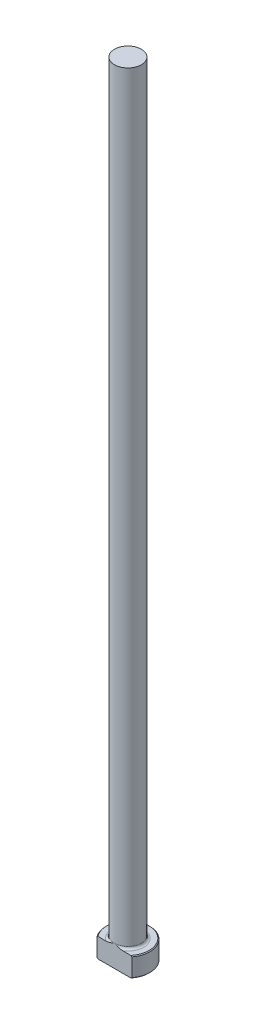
from build123d import *

# Parameters (mm, degrees)
CHAMFER1_SIZE = 0.254
FILLET1_R     = 0.762
KEY_DEPTH     = 255.20048182


with BuildPart() as part:
    # Sketch1 → Revolve1 (revolve)
    with BuildSketch(Plane.XY, mode=Mode.PRIVATE) as revolve1_sk:
        Polygon((0, 0), (-7.1374, 0), (-7.1374, 6.35), (-4.36499, 6.35), (-4.36499, 254), (0, 254), align=None)
    revolve(revolve1_sk.sketch.rotate(Axis((0, 259.958771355, 0), (0, -1, 0)), 270), axis=Axis((0, 259.958771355, 0), (0, -1, 0)))

    # Chamfer1
    chamfer1_edges = [part.edges().sort_by_distance(p)[0] for p in [
        (0, 6.35, -7.1374),
        (0, 0, -7.1374),
    ]]
    chamfer(chamfer1_edges, length=CHAMFER1_SIZE)

    # Fillet1
    fillet1_edges = [part.edges().sort_by_distance(p)[0] for p in [
        (0, 6.35, -4.36499),
    ]]
    fillet(fillet1_edges, radius=FILLET1_R)

    # Sketch2 → Key (cut, through all)
    with BuildSketch(Plane(origin=(0, 0, 0), x_dir=(1, 0, 0), z_dir=(0, 1, 0))):
        with BuildLine():
            Line((-5.647064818, -4.36499), (5.647064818, -4.36499))
            ThreePointArc((5.647064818, -4.36499), (0, -7.1374), (-5.647064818, -4.36499))
        make_face()
    extrude(amount=KEY_DEPTH, mode=Mode.SUBTRACT)


solid = part.part
